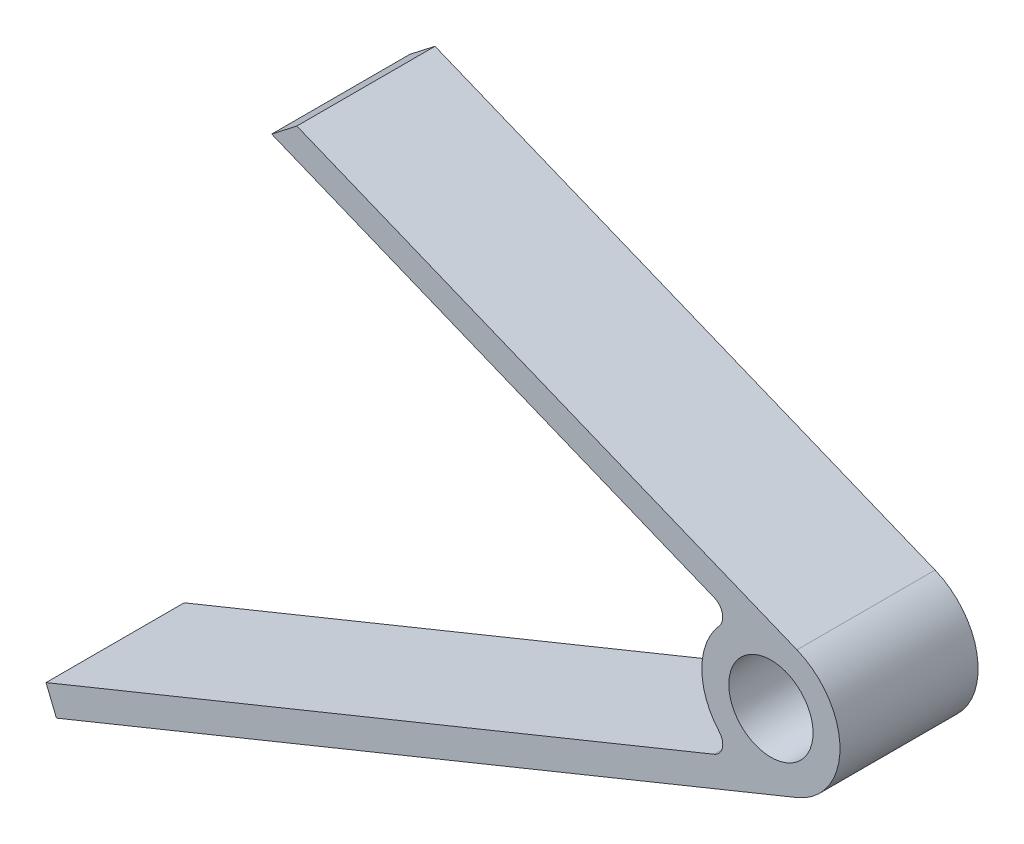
ISO-10303-21;
HEADER;
FILE_DESCRIPTION(('STEP AP214'),'2;1');
FILE_NAME('part.step','',(''),(''),'','','');
FILE_SCHEMA(('AUTOMOTIVE_DESIGN { 1 0 10303 214 1 1 1 1 }'));
ENDSEC;
DATA;
#1=APPLICATION_CONTEXT('core data for automotive mechanical design processes');
#2=APPLICATION_PROTOCOL_DEFINITION('international standard','automotive_design',2000,#1);
#3=PRODUCT_CONTEXT('',#1,'mechanical');
#4=PRODUCT('Part','Part','',(#3));
#5=PRODUCT_RELATED_PRODUCT_CATEGORY('part','',(#4));
#6=PRODUCT_DEFINITION_FORMATION('','',#4);
#7=PRODUCT_DEFINITION_CONTEXT('part definition',#1,'design');
#8=PRODUCT_DEFINITION('design','',#6,#7);
#9=PRODUCT_DEFINITION_SHAPE('','',#8);
#10=(LENGTH_UNIT() NAMED_UNIT(*) SI_UNIT(.MILLI.,.METRE.));
#11=(NAMED_UNIT(*) PLANE_ANGLE_UNIT() SI_UNIT($,.RADIAN.));
#12=(NAMED_UNIT(*) SI_UNIT($,.STERADIAN.) SOLID_ANGLE_UNIT());
#13=UNCERTAINTY_MEASURE_WITH_UNIT(LENGTH_MEASURE(1.E-05),#10,'distance_accuracy_value','');
#14=(GEOMETRIC_REPRESENTATION_CONTEXT(3) GLOBAL_UNCERTAINTY_ASSIGNED_CONTEXT((#13)) GLOBAL_UNIT_ASSIGNED_CONTEXT((#10,
#11,#12)) REPRESENTATION_CONTEXT('',''));
#15=CARTESIAN_POINT('',(0.,0.,0.));
#16=DIRECTION('',(0.,0.,1.));
#17=DIRECTION('',(1.,0.,0.));
#18=AXIS2_PLACEMENT_3D('',#15,#16,#17);
#19=CARTESIAN_POINT('',(0.,0.,10.));
#20=DIRECTION('',(0.,0.,1.));
#21=DIRECTION('',(1.,0.,0.));
#22=AXIS2_PLACEMENT_3D('',#19,#20,#21);
#23=PLANE('',#22);
#24=DIRECTION('',(-0.789619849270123,-0.61359636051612,0.));
#25=VECTOR('',#24,1.);
#26=CARTESIAN_POINT('',(-36.1376335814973,17.9497615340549,10.));
#27=LINE('',#26,#25);
#28=CARTESIAN_POINT('',(-34.314084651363,19.3668016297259,10.));
#29=VERTEX_POINT('',#28);
#30=CARTESIAN_POINT('',(-36.1376335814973,17.9497615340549,10.));
#31=VERTEX_POINT('',#30);
#32=EDGE_CURVE('E159',#29,#31,#27,.T.);
#33=ORIENTED_EDGE('',*,*,#32,.T.);
#34=DIRECTION('',(0.926199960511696,-0.377032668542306,0.));
#35=VECTOR('',#34,1.);
#36=CARTESIAN_POINT('',(-36.1376335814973,17.9497615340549,10.));
#37=LINE('',#36,#35);
#38=CARTESIAN_POINT('',(-4.10828017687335,4.91141873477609,10.));
#39=VERTEX_POINT('',#38);
#40=EDGE_CURVE('E97',#31,#39,#37,.T.);
#41=ORIENTED_EDGE('',*,*,#40,.T.);
#42=CARTESIAN_POINT('',(-4.48531284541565,3.98521877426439,10.));
#43=DIRECTION('',(0.,0.,-1.));
#44=DIRECTION('',(-1.,0.,0.));
#45=AXIS2_PLACEMENT_3D('',#42,#43,#44);
#46=CIRCLE('',#45,1.);
#47=CARTESIAN_POINT('',(-3.73776070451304,3.32101564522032,10.));
#48=VERTEX_POINT('',#47);
#49=EDGE_CURVE('E180',#39,#48,#46,.T.);
#50=ORIENTED_EDGE('',*,*,#49,.T.);
#51=CARTESIAN_POINT('',(0.,0.,10.));
#52=DIRECTION('',(0.,0.,1.));
#53=DIRECTION('',(1.,0.,0.));
#54=AXIS2_PLACEMENT_3D('',#51,#52,#53);
#55=CIRCLE('',#54,5.);
#56=CARTESIAN_POINT('',(-3.73776070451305,-3.32101564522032,10.));
#57=VERTEX_POINT('',#56);
#58=EDGE_CURVE('E199',#48,#57,#55,.T.);
#59=ORIENTED_EDGE('',*,*,#58,.T.);
#60=CARTESIAN_POINT('',(-4.48531284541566,-3.98521877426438,10.));
#61=DIRECTION('',(0.,0.,-1.));
#62=DIRECTION('',(1.,0.,0.));
#63=AXIS2_PLACEMENT_3D('',#60,#61,#62);
#64=CIRCLE('',#63,0.999999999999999);
#65=CARTESIAN_POINT('',(-4.10828017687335,-4.91141873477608,10.));
#66=VERTEX_POINT('',#65);
#67=EDGE_CURVE('E196',#57,#66,#64,.T.);
#68=ORIENTED_EDGE('',*,*,#67,.T.);
#69=DIRECTION('',(-0.926199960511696,-0.377032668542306,0.));
#70=VECTOR('',#69,1.);
#71=CARTESIAN_POINT('',(-52.4721843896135,-24.5991456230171,10.));
#72=LINE('',#71,#70);
#73=CARTESIAN_POINT('',(-52.4721843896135,-24.5991456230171,10.));
#74=VERTEX_POINT('',#73);
#75=EDGE_CURVE('E198',#66,#74,#72,.T.);
#76=ORIENTED_EDGE('',*,*,#75,.T.);
#77=DIRECTION('',(0.377032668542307,-0.926199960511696,0.));
#78=VECTOR('',#77,1.);
#79=CARTESIAN_POINT('',(-51.7181190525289,-26.4515455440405,10.));
#80=LINE('',#79,#78);
#81=CARTESIAN_POINT('',(-51.7181190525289,-26.4515455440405,10.));
#82=VERTEX_POINT('',#81);
#83=EDGE_CURVE('E122',#74,#82,#80,.T.);
#84=ORIENTED_EDGE('',*,*,#83,.T.);
#85=DIRECTION('',(0.926199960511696,0.377032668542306,0.));
#86=VECTOR('',#85,1.);
#87=CARTESIAN_POINT('',(-51.7181190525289,-26.4515455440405,10.));
#88=LINE('',#87,#86);
#89=CARTESIAN_POINT('',(1.88516334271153,-4.63099980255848,10.));
#90=VERTEX_POINT('',#89);
#91=EDGE_CURVE('E116',#82,#90,#88,.T.);
#92=ORIENTED_EDGE('',*,*,#91,.T.);
#93=CARTESIAN_POINT('',(0.,0.,10.));
#94=DIRECTION('',(0.,0.,1.));
#95=DIRECTION('',(1.,0.,0.));
#96=AXIS2_PLACEMENT_3D('',#93,#94,#95);
#97=CIRCLE('',#96,5.);
#98=CARTESIAN_POINT('',(1.88516334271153,4.63099980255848,10.));
#99=VERTEX_POINT('',#98);
#100=EDGE_CURVE('E120',#90,#99,#97,.T.);
#101=ORIENTED_EDGE('',*,*,#100,.T.);
#102=DIRECTION('',(-0.926199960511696,0.377032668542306,0.));
#103=VECTOR('',#102,1.);
#104=CARTESIAN_POINT('',(-34.314084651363,19.3668016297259,10.));
#105=LINE('',#104,#103);
#106=EDGE_CURVE('E48',#99,#29,#105,.T.);
#107=ORIENTED_EDGE('',*,*,#106,.T.);
#108=EDGE_LOOP('',(#33,#41,#50,#59,#68,#76,#84,#92,#101,#107));
#109=FACE_BOUND('',#108,.T.);
#110=CARTESIAN_POINT('',(0.,0.,10.));
#111=DIRECTION('',(0.,0.,1.));
#112=DIRECTION('',(1.,0.,0.));
#113=AXIS2_PLACEMENT_3D('',#110,#111,#112);
#114=CIRCLE('',#113,3.05);
#115=CARTESIAN_POINT('',(3.05,0.,10.));
#116=VERTEX_POINT('',#115);
#117=EDGE_CURVE('E144',#116,#116,#114,.T.);
#118=ORIENTED_EDGE('',*,*,#117,.F.);
#119=EDGE_LOOP('',(#118));
#120=FACE_BOUND('',#119,.T.);
#121=ADVANCED_FACE('F31',(#109,#120),#23,.T.);
#122=CARTESIAN_POINT('',(0.,0.,0.));
#123=DIRECTION('',(0.,0.,1.));
#124=DIRECTION('',(1.,0.,0.));
#125=AXIS2_PLACEMENT_3D('',#122,#123,#124);
#126=PLANE('',#125);
#127=DIRECTION('',(-0.789619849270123,-0.61359636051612,0.));
#128=VECTOR('',#127,1.);
#129=CARTESIAN_POINT('',(-36.1376335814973,17.9497615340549,0.));
#130=LINE('',#129,#128);
#131=CARTESIAN_POINT('',(-34.314084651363,19.3668016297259,0.));
#132=VERTEX_POINT('',#131);
#133=CARTESIAN_POINT('',(-36.1376335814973,17.9497615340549,0.));
#134=VERTEX_POINT('',#133);
#135=EDGE_CURVE('E140',#132,#134,#130,.T.);
#136=ORIENTED_EDGE('',*,*,#135,.F.);
#137=DIRECTION('',(-0.926199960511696,0.377032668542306,0.));
#138=VECTOR('',#137,1.);
#139=CARTESIAN_POINT('',(-34.314084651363,19.3668016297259,0.));
#140=LINE('',#139,#138);
#141=CARTESIAN_POINT('',(1.88516334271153,4.63099980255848,0.));
#142=VERTEX_POINT('',#141);
#143=EDGE_CURVE('E89',#142,#132,#140,.T.);
#144=ORIENTED_EDGE('',*,*,#143,.F.);
#145=CARTESIAN_POINT('',(0.,0.,0.));
#146=DIRECTION('',(0.,0.,1.));
#147=DIRECTION('',(1.,0.,0.));
#148=AXIS2_PLACEMENT_3D('',#145,#146,#147);
#149=CIRCLE('',#148,5.);
#150=CARTESIAN_POINT('',(1.88516334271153,-4.63099980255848,0.));
#151=VERTEX_POINT('',#150);
#152=EDGE_CURVE('E83',#151,#142,#149,.T.);
#153=ORIENTED_EDGE('',*,*,#152,.F.);
#154=DIRECTION('',(0.926199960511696,0.377032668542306,0.));
#155=VECTOR('',#154,1.);
#156=CARTESIAN_POINT('',(-51.7181190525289,-26.4515455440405,0.));
#157=LINE('',#156,#155);
#158=CARTESIAN_POINT('',(-51.7181190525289,-26.4515455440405,0.));
#159=VERTEX_POINT('',#158);
#160=EDGE_CURVE('E130',#159,#151,#157,.T.);
#161=ORIENTED_EDGE('',*,*,#160,.F.);
#162=DIRECTION('',(0.377032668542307,-0.926199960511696,0.));
#163=VECTOR('',#162,1.);
#164=CARTESIAN_POINT('',(-51.7181190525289,-26.4515455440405,0.));
#165=LINE('',#164,#163);
#166=CARTESIAN_POINT('',(-52.4721843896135,-24.5991456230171,0.));
#167=VERTEX_POINT('',#166);
#168=EDGE_CURVE('E154',#167,#159,#165,.T.);
#169=ORIENTED_EDGE('',*,*,#168,.F.);
#170=DIRECTION('',(-0.926199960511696,-0.377032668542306,0.));
#171=VECTOR('',#170,1.);
#172=CARTESIAN_POINT('',(-52.4721843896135,-24.5991456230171,0.));
#173=LINE('',#172,#171);
#174=CARTESIAN_POINT('',(-4.10828017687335,-4.91141873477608,0.));
#175=VERTEX_POINT('',#174);
#176=EDGE_CURVE('E152',#175,#167,#173,.T.);
#177=ORIENTED_EDGE('',*,*,#176,.F.);
#178=CARTESIAN_POINT('',(-4.48531284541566,-3.98521877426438,0.));
#179=DIRECTION('',(0.,0.,-1.));
#180=DIRECTION('',(1.,0.,0.));
#181=AXIS2_PLACEMENT_3D('',#178,#179,#180);
#182=CIRCLE('',#181,0.999999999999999);
#183=CARTESIAN_POINT('',(-3.73776070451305,-3.32101564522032,0.));
#184=VERTEX_POINT('',#183);
#185=EDGE_CURVE('E150',#184,#175,#182,.T.);
#186=ORIENTED_EDGE('',*,*,#185,.F.);
#187=CARTESIAN_POINT('',(0.,0.,0.));
#188=DIRECTION('',(0.,0.,1.));
#189=DIRECTION('',(1.,0.,0.));
#190=AXIS2_PLACEMENT_3D('',#187,#188,#189);
#191=CIRCLE('',#190,5.);
#192=CARTESIAN_POINT('',(-3.73776070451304,3.32101564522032,0.));
#193=VERTEX_POINT('',#192);
#194=EDGE_CURVE('E148',#193,#184,#191,.T.);
#195=ORIENTED_EDGE('',*,*,#194,.F.);
#196=CARTESIAN_POINT('',(-4.48531284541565,3.98521877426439,0.));
#197=DIRECTION('',(0.,0.,-1.));
#198=DIRECTION('',(-1.,0.,0.));
#199=AXIS2_PLACEMENT_3D('',#196,#197,#198);
#200=CIRCLE('',#199,1.);
#201=CARTESIAN_POINT('',(-4.10828017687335,4.91141873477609,0.));
#202=VERTEX_POINT('',#201);
#203=EDGE_CURVE('E146',#202,#193,#200,.T.);
#204=ORIENTED_EDGE('',*,*,#203,.F.);
#205=DIRECTION('',(0.926199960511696,-0.377032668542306,0.));
#206=VECTOR('',#205,1.);
#207=CARTESIAN_POINT('',(-36.1376335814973,17.9497615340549,0.));
#208=LINE('',#207,#206);
#209=EDGE_CURVE('E143',#134,#202,#208,.T.);
#210=ORIENTED_EDGE('',*,*,#209,.F.);
#211=EDGE_LOOP('',(#136,#144,#153,#161,#169,#177,#186,#195,#204,#210));
#212=FACE_BOUND('',#211,.T.);
#213=CARTESIAN_POINT('',(0.,0.,0.));
#214=DIRECTION('',(0.,0.,1.));
#215=DIRECTION('',(1.,0.,0.));
#216=AXIS2_PLACEMENT_3D('',#213,#214,#215);
#217=CIRCLE('',#216,3.05);
#218=CARTESIAN_POINT('',(3.05,0.,0.));
#219=VERTEX_POINT('',#218);
#220=EDGE_CURVE('E207',#219,#219,#217,.T.);
#221=ORIENTED_EDGE('',*,*,#220,.T.);
#222=EDGE_LOOP('',(#221));
#223=FACE_BOUND('',#222,.T.);
#224=ADVANCED_FACE('F184',(#212,#223),#126,.F.);
#225=CARTESIAN_POINT('',(-36.1376335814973,17.9497615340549,10.));
#226=DIRECTION('',(0.61359636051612,-0.789619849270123,0.));
#227=DIRECTION('',(0.789619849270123,0.61359636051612,0.));
#228=AXIS2_PLACEMENT_3D('',#225,#226,#227);
#229=PLANE('',#228);
#230=ORIENTED_EDGE('',*,*,#135,.T.);
#231=DIRECTION('',(0.,0.,-1.));
#232=VECTOR('',#231,1.);
#233=CARTESIAN_POINT('',(-36.1376335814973,17.9497615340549,10.));
#234=LINE('',#233,#232);
#235=EDGE_CURVE('E11',#31,#134,#234,.T.);
#236=ORIENTED_EDGE('',*,*,#235,.F.);
#237=ORIENTED_EDGE('',*,*,#32,.F.);
#238=DIRECTION('',(0.,0.,-1.));
#239=VECTOR('',#238,1.);
#240=CARTESIAN_POINT('',(-34.314084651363,19.3668016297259,10.));
#241=LINE('',#240,#239);
#242=EDGE_CURVE('E136',#29,#132,#241,.T.);
#243=ORIENTED_EDGE('',*,*,#242,.T.);
#244=EDGE_LOOP('',(#230,#236,#237,#243));
#245=FACE_BOUND('',#244,.T.);
#246=ADVANCED_FACE('F33',(#245),#229,.F.);
#247=CARTESIAN_POINT('',(-36.1376335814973,17.9497615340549,10.));
#248=DIRECTION('',(0.377032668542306,0.926199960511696,0.));
#249=DIRECTION('',(-0.926199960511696,0.377032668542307,0.));
#250=AXIS2_PLACEMENT_3D('',#247,#248,#249);
#251=PLANE('',#250);
#252=ORIENTED_EDGE('',*,*,#209,.T.);
#253=DIRECTION('',(0.,0.,-1.));
#254=VECTOR('',#253,1.);
#255=CARTESIAN_POINT('',(-4.10828017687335,4.91141873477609,10.));
#256=LINE('',#255,#254);
#257=EDGE_CURVE('E40',#39,#202,#256,.T.);
#258=ORIENTED_EDGE('',*,*,#257,.F.);
#259=ORIENTED_EDGE('',*,*,#40,.F.);
#260=ORIENTED_EDGE('',*,*,#235,.T.);
#261=EDGE_LOOP('',(#252,#258,#259,#260));
#262=FACE_BOUND('',#261,.T.);
#263=ADVANCED_FACE('F243',(#262),#251,.F.);
#264=CARTESIAN_POINT('',(-4.48531284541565,3.98521877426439,10.));
#265=DIRECTION('',(0.,0.,-1.));
#266=DIRECTION('',(-1.,0.,0.));
#267=AXIS2_PLACEMENT_3D('',#264,#265,#266);
#268=CYLINDRICAL_SURFACE('',#267,1.);
#269=ORIENTED_EDGE('',*,*,#203,.T.);
#270=DIRECTION('',(0.,0.,-1.));
#271=VECTOR('',#270,1.);
#272=CARTESIAN_POINT('',(-3.73776070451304,3.32101564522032,10.));
#273=LINE('',#272,#271);
#274=EDGE_CURVE('E172',#48,#193,#273,.T.);
#275=ORIENTED_EDGE('',*,*,#274,.F.);
#276=ORIENTED_EDGE('',*,*,#49,.F.);
#277=ORIENTED_EDGE('',*,*,#257,.T.);
#278=EDGE_LOOP('',(#269,#275,#276,#277));
#279=FACE_BOUND('',#278,.T.);
#280=ADVANCED_FACE('F178',(#279),#268,.F.);
#281=CARTESIAN_POINT('',(0.,0.,10.));
#282=DIRECTION('',(0.,0.,-1.));
#283=DIRECTION('',(-1.,0.,0.));
#284=AXIS2_PLACEMENT_3D('',#281,#282,#283);
#285=CYLINDRICAL_SURFACE('',#284,5.);
#286=ORIENTED_EDGE('',*,*,#194,.T.);
#287=DIRECTION('',(0.,0.,-1.));
#288=VECTOR('',#287,1.);
#289=CARTESIAN_POINT('',(-3.73776070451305,-3.32101564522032,10.));
#290=LINE('',#289,#288);
#291=EDGE_CURVE('E169',#57,#184,#290,.T.);
#292=ORIENTED_EDGE('',*,*,#291,.F.);
#293=ORIENTED_EDGE('',*,*,#58,.F.);
#294=ORIENTED_EDGE('',*,*,#274,.T.);
#295=EDGE_LOOP('',(#286,#292,#293,#294));
#296=FACE_BOUND('',#295,.T.);
#297=ADVANCED_FACE('F190',(#296),#285,.T.);
#298=CARTESIAN_POINT('',(-4.48531284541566,-3.98521877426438,10.));
#299=DIRECTION('',(0.,0.,-1.));
#300=DIRECTION('',(-1.,0.,0.));
#301=AXIS2_PLACEMENT_3D('',#298,#299,#300);
#302=CYLINDRICAL_SURFACE('',#301,0.999999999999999);
#303=ORIENTED_EDGE('',*,*,#185,.T.);
#304=DIRECTION('',(0.,0.,-1.));
#305=VECTOR('',#304,1.);
#306=CARTESIAN_POINT('',(-4.10828017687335,-4.91141873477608,10.));
#307=LINE('',#306,#305);
#308=EDGE_CURVE('E166',#66,#175,#307,.T.);
#309=ORIENTED_EDGE('',*,*,#308,.F.);
#310=ORIENTED_EDGE('',*,*,#67,.F.);
#311=ORIENTED_EDGE('',*,*,#291,.T.);
#312=EDGE_LOOP('',(#303,#309,#310,#311));
#313=FACE_BOUND('',#312,.T.);
#314=ADVANCED_FACE('F194',(#313),#302,.F.);
#315=CARTESIAN_POINT('',(-52.4721843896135,-24.5991456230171,10.));
#316=DIRECTION('',(0.377032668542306,-0.926199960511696,0.));
#317=DIRECTION('',(0.926199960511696,0.377032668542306,0.));
#318=AXIS2_PLACEMENT_3D('',#315,#316,#317);
#319=PLANE('',#318);
#320=ORIENTED_EDGE('',*,*,#176,.T.);
#321=DIRECTION('',(0.,0.,-1.));
#322=VECTOR('',#321,1.);
#323=CARTESIAN_POINT('',(-52.4721843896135,-24.5991456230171,10.));
#324=LINE('',#323,#322);
#325=EDGE_CURVE('E163',#74,#167,#324,.T.);
#326=ORIENTED_EDGE('',*,*,#325,.F.);
#327=ORIENTED_EDGE('',*,*,#75,.F.);
#328=ORIENTED_EDGE('',*,*,#308,.T.);
#329=EDGE_LOOP('',(#320,#326,#327,#328));
#330=FACE_BOUND('',#329,.T.);
#331=ADVANCED_FACE('F233',(#330),#319,.F.);
#332=CARTESIAN_POINT('',(-51.7181190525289,-26.4515455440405,10.));
#333=DIRECTION('',(0.926199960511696,0.377032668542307,0.));
#334=DIRECTION('',(-0.377032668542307,0.926199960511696,0.));
#335=AXIS2_PLACEMENT_3D('',#332,#333,#334);
#336=PLANE('',#335);
#337=ORIENTED_EDGE('',*,*,#168,.T.);
#338=DIRECTION('',(0.,0.,-1.));
#339=VECTOR('',#338,1.);
#340=CARTESIAN_POINT('',(-51.7181190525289,-26.4515455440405,10.));
#341=LINE('',#340,#339);
#342=EDGE_CURVE('E131',#82,#159,#341,.T.);
#343=ORIENTED_EDGE('',*,*,#342,.F.);
#344=ORIENTED_EDGE('',*,*,#83,.F.);
#345=ORIENTED_EDGE('',*,*,#325,.T.);
#346=EDGE_LOOP('',(#337,#343,#344,#345));
#347=FACE_BOUND('',#346,.T.);
#348=ADVANCED_FACE('F230',(#347),#336,.F.);
#349=CARTESIAN_POINT('',(-51.7181190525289,-26.4515455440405,10.));
#350=DIRECTION('',(-0.377032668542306,0.926199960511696,0.));
#351=DIRECTION('',(-0.926199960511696,-0.377032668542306,0.));
#352=AXIS2_PLACEMENT_3D('',#349,#350,#351);
#353=PLANE('',#352);
#354=ORIENTED_EDGE('',*,*,#160,.T.);
#355=DIRECTION('',(0.,0.,-1.));
#356=VECTOR('',#355,1.);
#357=CARTESIAN_POINT('',(1.88516334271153,-4.63099980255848,10.));
#358=LINE('',#357,#356);
#359=EDGE_CURVE('E127',#90,#151,#358,.T.);
#360=ORIENTED_EDGE('',*,*,#359,.F.);
#361=ORIENTED_EDGE('',*,*,#91,.F.);
#362=ORIENTED_EDGE('',*,*,#342,.T.);
#363=EDGE_LOOP('',(#354,#360,#361,#362));
#364=FACE_BOUND('',#363,.T.);
#365=ADVANCED_FACE('F128',(#364),#353,.F.);
#366=CARTESIAN_POINT('',(0.,0.,10.));
#367=DIRECTION('',(0.,0.,-1.));
#368=DIRECTION('',(-1.,0.,0.));
#369=AXIS2_PLACEMENT_3D('',#366,#367,#368);
#370=CYLINDRICAL_SURFACE('',#369,5.);
#371=ORIENTED_EDGE('',*,*,#152,.T.);
#372=DIRECTION('',(0.,0.,-1.));
#373=VECTOR('',#372,1.);
#374=CARTESIAN_POINT('',(1.88516334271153,4.63099980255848,10.));
#375=LINE('',#374,#373);
#376=EDGE_CURVE('E132',#99,#142,#375,.T.);
#377=ORIENTED_EDGE('',*,*,#376,.F.);
#378=ORIENTED_EDGE('',*,*,#100,.F.);
#379=ORIENTED_EDGE('',*,*,#359,.T.);
#380=EDGE_LOOP('',(#371,#377,#378,#379));
#381=FACE_BOUND('',#380,.T.);
#382=ADVANCED_FACE('F134',(#381),#370,.T.);
#383=CARTESIAN_POINT('',(-34.314084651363,19.3668016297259,10.));
#384=DIRECTION('',(-0.377032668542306,-0.926199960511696,0.));
#385=DIRECTION('',(0.926199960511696,-0.377032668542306,0.));
#386=AXIS2_PLACEMENT_3D('',#383,#384,#385);
#387=PLANE('',#386);
#388=ORIENTED_EDGE('',*,*,#143,.T.);
#389=ORIENTED_EDGE('',*,*,#242,.F.);
#390=ORIENTED_EDGE('',*,*,#106,.F.);
#391=ORIENTED_EDGE('',*,*,#376,.T.);
#392=EDGE_LOOP('',(#388,#389,#390,#391));
#393=FACE_BOUND('',#392,.T.);
#394=ADVANCED_FACE('F223',(#393),#387,.F.);
#395=CARTESIAN_POINT('',(0.,0.,10.));
#396=DIRECTION('',(0.,0.,-1.));
#397=DIRECTION('',(-1.,0.,0.));
#398=AXIS2_PLACEMENT_3D('',#395,#396,#397);
#399=CYLINDRICAL_SURFACE('',#398,3.05);
#400=ORIENTED_EDGE('',*,*,#117,.T.);
#401=EDGE_LOOP('',(#400));
#402=FACE_BOUND('',#401,.T.);
#403=ORIENTED_EDGE('',*,*,#220,.F.);
#404=EDGE_LOOP('',(#403));
#405=FACE_BOUND('',#404,.T.);
#406=ADVANCED_FACE('F213',(#402,#405),#399,.F.);
#407=CLOSED_SHELL('',(#121,#224,#246,#263,#280,#297,#314,#331,#348,#365,#382,#394,#406));
#408=MANIFOLD_SOLID_BREP('B2',#407);
#409=ADVANCED_BREP_SHAPE_REPRESENTATION('',(#18,#408),#14);
#410=SHAPE_DEFINITION_REPRESENTATION(#9,#409);
ENDSEC;
END-ISO-10303-21;
